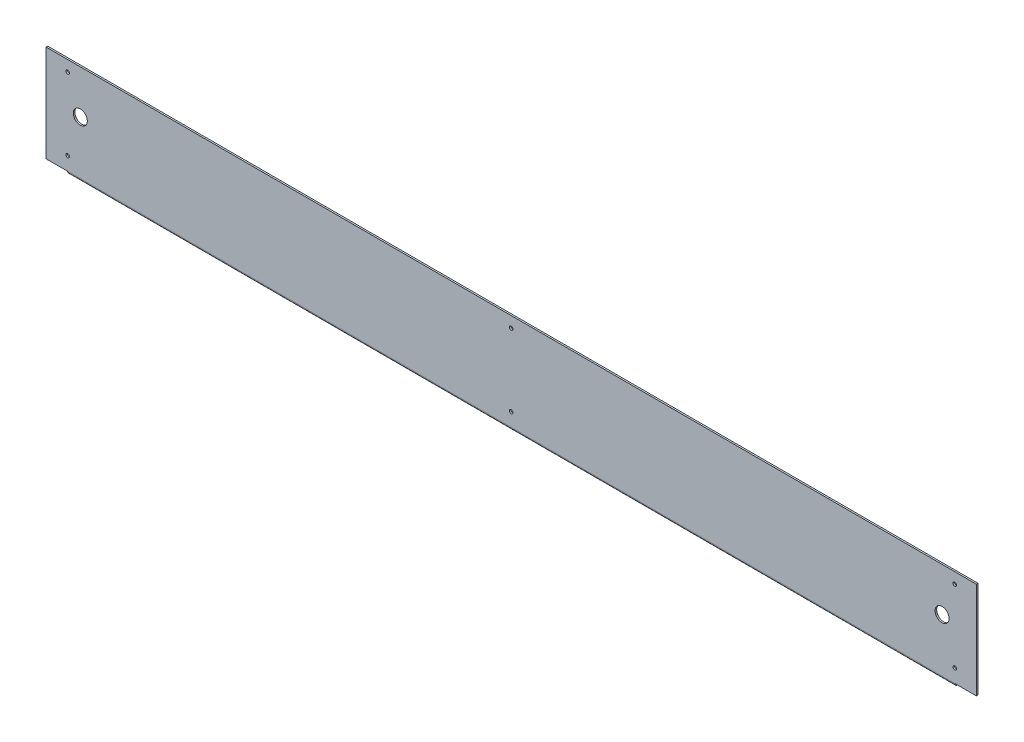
ISO-10303-21;
HEADER;
FILE_DESCRIPTION(('STEP AP214'),'2;1');
FILE_NAME('part.step','',(''),(''),'','','');
FILE_SCHEMA(('AUTOMOTIVE_DESIGN { 1 0 10303 214 1 1 1 1 }'));
ENDSEC;
DATA;
#1=APPLICATION_CONTEXT('core data for automotive mechanical design processes');
#2=APPLICATION_PROTOCOL_DEFINITION('international standard','automotive_design',2000,#1);
#3=PRODUCT_CONTEXT('',#1,'mechanical');
#4=PRODUCT('Part','Part','',(#3));
#5=PRODUCT_RELATED_PRODUCT_CATEGORY('part','',(#4));
#6=PRODUCT_DEFINITION_FORMATION('','',#4);
#7=PRODUCT_DEFINITION_CONTEXT('part definition',#1,'design');
#8=PRODUCT_DEFINITION('design','',#6,#7);
#9=PRODUCT_DEFINITION_SHAPE('','',#8);
#10=(LENGTH_UNIT() NAMED_UNIT(*) SI_UNIT(.MILLI.,.METRE.));
#11=(NAMED_UNIT(*) PLANE_ANGLE_UNIT() SI_UNIT($,.RADIAN.));
#12=(NAMED_UNIT(*) SI_UNIT($,.STERADIAN.) SOLID_ANGLE_UNIT());
#13=UNCERTAINTY_MEASURE_WITH_UNIT(LENGTH_MEASURE(1.E-05),#10,'distance_accuracy_value','');
#14=(GEOMETRIC_REPRESENTATION_CONTEXT(3) GLOBAL_UNCERTAINTY_ASSIGNED_CONTEXT((#13)) GLOBAL_UNIT_ASSIGNED_CONTEXT((#10,
#11,#12)) REPRESENTATION_CONTEXT('',''));
#15=CARTESIAN_POINT('',(0.,0.,0.));
#16=DIRECTION('',(0.,0.,1.));
#17=DIRECTION('',(1.,0.,0.));
#18=AXIS2_PLACEMENT_3D('',#15,#16,#17);
#19=CARTESIAN_POINT('',(-430.1,-100.999999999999,1.5));
#20=DIRECTION('',(0.,1.,0.));
#21=DIRECTION('',(-1.,0.,0.));
#22=AXIS2_PLACEMENT_3D('',#19,#20,#21);
#23=PLANE('',#22);
#24=DIRECTION('',(0.,-1.9428902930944E-13,1.));
#25=VECTOR('',#24,1.);
#26=CARTESIAN_POINT('',(410.1,-100.999999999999,-1.72171304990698E-13));
#27=LINE('',#26,#25);
#28=CARTESIAN_POINT('',(410.1,-100.999999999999,-1.72171304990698E-13));
#29=VERTEX_POINT('',#28);
#30=CARTESIAN_POINT('',(410.1,-101.,1.49999999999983));
#31=VERTEX_POINT('',#30);
#32=EDGE_CURVE('E205',#29,#31,#27,.T.);
#33=ORIENTED_EDGE('',*,*,#32,.F.);
#34=DIRECTION('',(1.,0.,0.));
#35=VECTOR('',#34,1.);
#36=CARTESIAN_POINT('',(-430.1,-100.999999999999,0.));
#37=LINE('',#36,#35);
#38=CARTESIAN_POINT('',(430.1,-100.999999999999,0.));
#39=VERTEX_POINT('',#38);
#40=EDGE_CURVE('E219',#29,#39,#37,.T.);
#41=ORIENTED_EDGE('',*,*,#40,.T.);
#42=DIRECTION('',(0.,0.,-1.));
#43=VECTOR('',#42,1.);
#44=CARTESIAN_POINT('',(430.1,-100.999999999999,1.5));
#45=LINE('',#44,#43);
#46=CARTESIAN_POINT('',(430.1,-100.999999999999,1.5));
#47=VERTEX_POINT('',#46);
#48=EDGE_CURVE('E66',#47,#39,#45,.T.);
#49=ORIENTED_EDGE('',*,*,#48,.F.);
#50=DIRECTION('',(1.,0.,0.));
#51=VECTOR('',#50,1.);
#52=CARTESIAN_POINT('',(-430.1,-100.999999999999,1.5));
#53=LINE('',#52,#51);
#54=EDGE_CURVE('E211',#31,#47,#53,.T.);
#55=ORIENTED_EDGE('',*,*,#54,.F.);
#56=EDGE_LOOP('',(#33,#41,#49,#55));
#57=FACE_BOUND('',#56,.T.);
#58=ADVANCED_FACE('F58',(#57),#23,.F.);
#59=CARTESIAN_POINT('',(-430.1,-11.4999999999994,1.5));
#60=DIRECTION('',(1.,0.,0.));
#61=DIRECTION('',(0.,0.,-1.));
#62=AXIS2_PLACEMENT_3D('',#59,#60,#61);
#63=PLANE('',#62);
#64=DIRECTION('',(0.,-1.,0.));
#65=VECTOR('',#64,1.);
#66=CARTESIAN_POINT('',(-430.1,-11.4999999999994,0.));
#67=LINE('',#66,#65);
#68=CARTESIAN_POINT('',(-430.1,-11.4999999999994,0.));
#69=VERTEX_POINT('',#68);
#70=CARTESIAN_POINT('',(-430.1,-100.999999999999,0.));
#71=VERTEX_POINT('',#70);
#72=EDGE_CURVE('E207',#69,#71,#67,.T.);
#73=ORIENTED_EDGE('',*,*,#72,.T.);
#74=DIRECTION('',(0.,0.,-1.));
#75=VECTOR('',#74,1.);
#76=CARTESIAN_POINT('',(-430.1,-100.999999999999,1.5));
#77=LINE('',#76,#75);
#78=CARTESIAN_POINT('',(-430.1,-100.999999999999,1.5));
#79=VERTEX_POINT('',#78);
#80=EDGE_CURVE('E13',#79,#71,#77,.T.);
#81=ORIENTED_EDGE('',*,*,#80,.F.);
#82=DIRECTION('',(0.,-1.,0.));
#83=VECTOR('',#82,1.);
#84=CARTESIAN_POINT('',(-430.1,-11.4999999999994,1.5));
#85=LINE('',#84,#83);
#86=CARTESIAN_POINT('',(-430.1,-11.4999999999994,1.5));
#87=VERTEX_POINT('',#86);
#88=EDGE_CURVE('E209',#87,#79,#85,.T.);
#89=ORIENTED_EDGE('',*,*,#88,.F.);
#90=DIRECTION('',(0.,0.,-1.));
#91=VECTOR('',#90,1.);
#92=CARTESIAN_POINT('',(-430.1,-11.4999999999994,1.5));
#93=LINE('',#92,#91);
#94=EDGE_CURVE('E216',#87,#69,#93,.T.);
#95=ORIENTED_EDGE('',*,*,#94,.T.);
#96=EDGE_LOOP('',(#73,#81,#89,#95));
#97=FACE_BOUND('',#96,.T.);
#98=ADVANCED_FACE('F60',(#97),#63,.F.);
#99=CARTESIAN_POINT('',(-410.1,-100.999999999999,0.));
#100=VERTEX_POINT('',#99);
#101=EDGE_CURVE('E220',#71,#100,#37,.T.);
#102=ORIENTED_EDGE('',*,*,#101,.T.);
#103=DIRECTION('',(0.,-1.9428902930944E-13,1.));
#104=VECTOR('',#103,1.);
#105=CARTESIAN_POINT('',(-410.1,-100.999999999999,0.));
#106=LINE('',#105,#104);
#107=CARTESIAN_POINT('',(-410.1,-100.999999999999,1.5));
#108=VERTEX_POINT('',#107);
#109=EDGE_CURVE('E198',#100,#108,#106,.T.);
#110=ORIENTED_EDGE('',*,*,#109,.T.);
#111=EDGE_CURVE('E110',#79,#108,#53,.T.);
#112=ORIENTED_EDGE('',*,*,#111,.F.);
#113=ORIENTED_EDGE('',*,*,#80,.T.);
#114=EDGE_LOOP('',(#102,#110,#112,#113));
#115=FACE_BOUND('',#114,.T.);
#116=ADVANCED_FACE('F255',(#115),#23,.F.);
#117=CARTESIAN_POINT('',(430.1,-11.499999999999,1.5));
#118=DIRECTION('',(-1.,0.,0.));
#119=DIRECTION('',(0.,0.,1.));
#120=AXIS2_PLACEMENT_3D('',#117,#118,#119);
#121=PLANE('',#120);
#122=DIRECTION('',(0.,1.,0.));
#123=VECTOR('',#122,1.);
#124=CARTESIAN_POINT('',(430.1,-11.499999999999,0.));
#125=LINE('',#124,#123);
#126=CARTESIAN_POINT('',(430.1,-11.499999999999,0.));
#127=VERTEX_POINT('',#126);
#128=EDGE_CURVE('E223',#39,#127,#125,.T.);
#129=ORIENTED_EDGE('',*,*,#128,.T.);
#130=DIRECTION('',(0.,0.,-1.));
#131=VECTOR('',#130,1.);
#132=CARTESIAN_POINT('',(430.1,-11.499999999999,1.5));
#133=LINE('',#132,#131);
#134=CARTESIAN_POINT('',(430.1,-11.499999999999,1.5));
#135=VERTEX_POINT('',#134);
#136=EDGE_CURVE('E227',#135,#127,#133,.T.);
#137=ORIENTED_EDGE('',*,*,#136,.F.);
#138=DIRECTION('',(0.,1.,0.));
#139=VECTOR('',#138,1.);
#140=CARTESIAN_POINT('',(430.1,-11.499999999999,1.5));
#141=LINE('',#140,#139);
#142=EDGE_CURVE('E213',#47,#135,#141,.T.);
#143=ORIENTED_EDGE('',*,*,#142,.F.);
#144=ORIENTED_EDGE('',*,*,#48,.T.);
#145=EDGE_LOOP('',(#129,#137,#143,#144));
#146=FACE_BOUND('',#145,.T.);
#147=ADVANCED_FACE('F233',(#146),#121,.F.);
#148=CARTESIAN_POINT('',(-430.1,-11.4999999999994,1.5));
#149=DIRECTION('',(0.,-1.,0.));
#150=DIRECTION('',(1.,0.,0.));
#151=AXIS2_PLACEMENT_3D('',#148,#149,#150);
#152=PLANE('',#151);
#153=DIRECTION('',(-1.,0.,0.));
#154=VECTOR('',#153,1.);
#155=CARTESIAN_POINT('',(-430.1,-11.4999999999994,0.));
#156=LINE('',#155,#154);
#157=EDGE_CURVE('E103',#127,#69,#156,.T.);
#158=ORIENTED_EDGE('',*,*,#157,.T.);
#159=ORIENTED_EDGE('',*,*,#94,.F.);
#160=DIRECTION('',(-1.,0.,0.));
#161=VECTOR('',#160,1.);
#162=CARTESIAN_POINT('',(-430.1,-11.4999999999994,1.5));
#163=LINE('',#162,#161);
#164=EDGE_CURVE('E82',#135,#87,#163,.T.);
#165=ORIENTED_EDGE('',*,*,#164,.F.);
#166=ORIENTED_EDGE('',*,*,#136,.T.);
#167=EDGE_LOOP('',(#158,#159,#165,#166));
#168=FACE_BOUND('',#167,.T.);
#169=ADVANCED_FACE('F245',(#168),#152,.F.);
#170=CARTESIAN_POINT('',(0.,0.,1.5));
#171=DIRECTION('',(0.,0.,1.));
#172=DIRECTION('',(1.,0.,0.));
#173=AXIS2_PLACEMENT_3D('',#170,#171,#172);
#174=PLANE('',#173);
#175=CARTESIAN_POINT('',(398.399999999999,-51.7500000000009,1.5));
#176=DIRECTION('',(0.,0.,1.));
#177=DIRECTION('',(1.,0.,0.));
#178=AXIS2_PLACEMENT_3D('',#175,#176,#177);
#179=CIRCLE('',#178,6.50000000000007);
#180=CARTESIAN_POINT('',(404.899999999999,-51.7500000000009,1.5));
#181=VERTEX_POINT('',#180);
#182=EDGE_CURVE('E324',#181,#181,#179,.T.);
#183=ORIENTED_EDGE('',*,*,#182,.F.);
#184=EDGE_LOOP('',(#183));
#185=FACE_BOUND('',#184,.T.);
#186=CARTESIAN_POINT('',(-398.4,-51.7500000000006,1.5));
#187=DIRECTION('',(0.,0.,1.));
#188=DIRECTION('',(1.,0.,0.));
#189=AXIS2_PLACEMENT_3D('',#186,#187,#188);
#190=CIRCLE('',#189,6.50000000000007);
#191=CARTESIAN_POINT('',(-391.9,-51.7500000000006,1.5));
#192=VERTEX_POINT('',#191);
#193=EDGE_CURVE('E318',#192,#192,#190,.T.);
#194=ORIENTED_EDGE('',*,*,#193,.F.);
#195=EDGE_LOOP('',(#194));
#196=FACE_BOUND('',#195,.T.);
#197=CARTESIAN_POINT('',(410.1,-21.4999999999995,1.5));
#198=DIRECTION('',(0.,0.,1.));
#199=DIRECTION('',(1.,0.,0.));
#200=AXIS2_PLACEMENT_3D('',#197,#198,#199);
#201=CIRCLE('',#200,1.65000000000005);
#202=CARTESIAN_POINT('',(411.75,-21.4999999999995,1.5));
#203=VERTEX_POINT('',#202);
#204=EDGE_CURVE('E300',#203,#203,#201,.T.);
#205=ORIENTED_EDGE('',*,*,#204,.F.);
#206=EDGE_LOOP('',(#205));
#207=FACE_BOUND('',#206,.T.);
#208=CARTESIAN_POINT('',(4.44089209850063E-13,-88.4999999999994,1.5));
#209=DIRECTION('',(0.,0.,1.));
#210=DIRECTION('',(1.,0.,0.));
#211=AXIS2_PLACEMENT_3D('',#208,#209,#210);
#212=CIRCLE('',#211,1.64999999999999);
#213=CARTESIAN_POINT('',(1.65000000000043,-88.4999999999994,1.5));
#214=VERTEX_POINT('',#213);
#215=EDGE_CURVE('E307',#214,#214,#212,.T.);
#216=ORIENTED_EDGE('',*,*,#215,.F.);
#217=EDGE_LOOP('',(#216));
#218=FACE_BOUND('',#217,.T.);
#219=CARTESIAN_POINT('',(-1.66533453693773E-13,-21.4999999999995,1.5));
#220=DIRECTION('',(0.,0.,1.));
#221=DIRECTION('',(1.,0.,0.));
#222=AXIS2_PLACEMENT_3D('',#219,#220,#221);
#223=CIRCLE('',#222,1.64999999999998);
#224=CARTESIAN_POINT('',(1.64999999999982,-21.4999999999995,1.5));
#225=VERTEX_POINT('',#224);
#226=EDGE_CURVE('E288',#225,#225,#223,.T.);
#227=ORIENTED_EDGE('',*,*,#226,.F.);
#228=EDGE_LOOP('',(#227));
#229=FACE_BOUND('',#228,.T.);
#230=CARTESIAN_POINT('',(-410.099999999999,-88.4999999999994,1.5));
#231=DIRECTION('',(0.,0.,1.));
#232=DIRECTION('',(1.,0.,0.));
#233=AXIS2_PLACEMENT_3D('',#230,#231,#232);
#234=CIRCLE('',#233,1.65000000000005);
#235=CARTESIAN_POINT('',(-408.449999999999,-88.4999999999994,1.5));
#236=VERTEX_POINT('',#235);
#237=EDGE_CURVE('E295',#236,#236,#234,.T.);
#238=ORIENTED_EDGE('',*,*,#237,.F.);
#239=EDGE_LOOP('',(#238));
#240=FACE_BOUND('',#239,.T.);
#241=CARTESIAN_POINT('',(410.1,-88.4999999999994,1.5));
#242=DIRECTION('',(0.,0.,1.));
#243=DIRECTION('',(1.,0.,0.));
#244=AXIS2_PLACEMENT_3D('',#241,#242,#243);
#245=CIRCLE('',#244,1.65000000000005);
#246=CARTESIAN_POINT('',(411.75,-88.4999999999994,1.5));
#247=VERTEX_POINT('',#246);
#248=EDGE_CURVE('E312',#247,#247,#245,.T.);
#249=ORIENTED_EDGE('',*,*,#248,.F.);
#250=EDGE_LOOP('',(#249));
#251=FACE_BOUND('',#250,.T.);
#252=CARTESIAN_POINT('',(-410.1,-21.4999999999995,1.5));
#253=DIRECTION('',(0.,0.,1.));
#254=DIRECTION('',(1.,0.,0.));
#255=AXIS2_PLACEMENT_3D('',#252,#253,#254);
#256=CIRCLE('',#255,1.65000000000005);
#257=CARTESIAN_POINT('',(-408.45,-21.4999999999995,1.5));
#258=VERTEX_POINT('',#257);
#259=EDGE_CURVE('E282',#258,#258,#256,.T.);
#260=ORIENTED_EDGE('',*,*,#259,.F.);
#261=EDGE_LOOP('',(#260));
#262=FACE_BOUND('',#261,.T.);
#263=ORIENTED_EDGE('',*,*,#88,.T.);
#264=ORIENTED_EDGE('',*,*,#111,.T.);
#265=DIRECTION('',(-1.,0.,0.));
#266=VECTOR('',#265,1.);
#267=CARTESIAN_POINT('',(-410.1,-101.,1.49999999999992));
#268=LINE('',#267,#266);
#269=EDGE_CURVE('E149',#108,#31,#268,.F.);
#270=ORIENTED_EDGE('',*,*,#269,.T.);
#271=ORIENTED_EDGE('',*,*,#54,.T.);
#272=ORIENTED_EDGE('',*,*,#142,.T.);
#273=ORIENTED_EDGE('',*,*,#164,.T.);
#274=EDGE_LOOP('',(#263,#264,#270,#271,#272,#273));
#275=FACE_BOUND('',#274,.T.);
#276=ADVANCED_FACE('F247',(#185,#196,#207,#218,#229,#240,#251,#262,#275),#174,.T.);
#277=CARTESIAN_POINT('',(0.,0.,0.));
#278=DIRECTION('',(0.,0.,1.));
#279=DIRECTION('',(1.,0.,0.));
#280=AXIS2_PLACEMENT_3D('',#277,#278,#279);
#281=PLANE('',#280);
#282=CARTESIAN_POINT('',(398.399999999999,-51.7500000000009,0.));
#283=DIRECTION('',(0.,0.,1.));
#284=DIRECTION('',(1.,0.,0.));
#285=AXIS2_PLACEMENT_3D('',#282,#283,#284);
#286=CIRCLE('',#285,6.50000000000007);
#287=CARTESIAN_POINT('',(404.899999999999,-51.7500000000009,0.));
#288=VERTEX_POINT('',#287);
#289=EDGE_CURVE('E315',#288,#288,#286,.T.);
#290=ORIENTED_EDGE('',*,*,#289,.T.);
#291=EDGE_LOOP('',(#290));
#292=FACE_BOUND('',#291,.T.);
#293=CARTESIAN_POINT('',(-398.4,-51.7500000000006,0.));
#294=DIRECTION('',(0.,0.,1.));
#295=DIRECTION('',(1.,0.,0.));
#296=AXIS2_PLACEMENT_3D('',#293,#294,#295);
#297=CIRCLE('',#296,6.50000000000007);
#298=CARTESIAN_POINT('',(-391.9,-51.7500000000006,0.));
#299=VERTEX_POINT('',#298);
#300=EDGE_CURVE('E321',#299,#299,#297,.T.);
#301=ORIENTED_EDGE('',*,*,#300,.T.);
#302=EDGE_LOOP('',(#301));
#303=FACE_BOUND('',#302,.T.);
#304=CARTESIAN_POINT('',(410.1,-21.4999999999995,0.));
#305=DIRECTION('',(0.,0.,1.));
#306=DIRECTION('',(1.,0.,0.));
#307=AXIS2_PLACEMENT_3D('',#304,#305,#306);
#308=CIRCLE('',#307,1.65000000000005);
#309=CARTESIAN_POINT('',(411.75,-21.4999999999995,0.));
#310=VERTEX_POINT('',#309);
#311=EDGE_CURVE('E303',#310,#310,#308,.T.);
#312=ORIENTED_EDGE('',*,*,#311,.T.);
#313=EDGE_LOOP('',(#312));
#314=FACE_BOUND('',#313,.T.);
#315=CARTESIAN_POINT('',(4.44089209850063E-13,-88.4999999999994,0.));
#316=DIRECTION('',(0.,0.,1.));
#317=DIRECTION('',(1.,0.,0.));
#318=AXIS2_PLACEMENT_3D('',#315,#316,#317);
#319=CIRCLE('',#318,1.64999999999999);
#320=CARTESIAN_POINT('',(1.65000000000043,-88.4999999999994,0.));
#321=VERTEX_POINT('',#320);
#322=EDGE_CURVE('E292',#321,#321,#319,.T.);
#323=ORIENTED_EDGE('',*,*,#322,.T.);
#324=EDGE_LOOP('',(#323));
#325=FACE_BOUND('',#324,.T.);
#326=CARTESIAN_POINT('',(-1.66533453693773E-13,-21.4999999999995,0.));
#327=DIRECTION('',(0.,0.,1.));
#328=DIRECTION('',(1.,0.,0.));
#329=AXIS2_PLACEMENT_3D('',#326,#327,#328);
#330=CIRCLE('',#329,1.64999999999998);
#331=CARTESIAN_POINT('',(1.64999999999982,-21.4999999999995,0.));
#332=VERTEX_POINT('',#331);
#333=EDGE_CURVE('E291',#332,#332,#330,.T.);
#334=ORIENTED_EDGE('',*,*,#333,.T.);
#335=EDGE_LOOP('',(#334));
#336=FACE_BOUND('',#335,.T.);
#337=CARTESIAN_POINT('',(-410.099999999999,-88.4999999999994,0.));
#338=DIRECTION('',(0.,0.,1.));
#339=DIRECTION('',(1.,0.,0.));
#340=AXIS2_PLACEMENT_3D('',#337,#338,#339);
#341=CIRCLE('',#340,1.65000000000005);
#342=CARTESIAN_POINT('',(-408.449999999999,-88.4999999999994,0.));
#343=VERTEX_POINT('',#342);
#344=EDGE_CURVE('E285',#343,#343,#341,.T.);
#345=ORIENTED_EDGE('',*,*,#344,.T.);
#346=EDGE_LOOP('',(#345));
#347=FACE_BOUND('',#346,.T.);
#348=CARTESIAN_POINT('',(410.1,-88.4999999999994,0.));
#349=DIRECTION('',(0.,0.,1.));
#350=DIRECTION('',(1.,0.,0.));
#351=AXIS2_PLACEMENT_3D('',#348,#349,#350);
#352=CIRCLE('',#351,1.65000000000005);
#353=CARTESIAN_POINT('',(411.75,-88.4999999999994,0.));
#354=VERTEX_POINT('',#353);
#355=EDGE_CURVE('E304',#354,#354,#352,.T.);
#356=ORIENTED_EDGE('',*,*,#355,.T.);
#357=EDGE_LOOP('',(#356));
#358=FACE_BOUND('',#357,.T.);
#359=CARTESIAN_POINT('',(-410.1,-21.4999999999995,0.));
#360=DIRECTION('',(0.,0.,1.));
#361=DIRECTION('',(1.,0.,0.));
#362=AXIS2_PLACEMENT_3D('',#359,#360,#361);
#363=CIRCLE('',#362,1.65000000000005);
#364=CARTESIAN_POINT('',(-408.45,-21.4999999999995,0.));
#365=VERTEX_POINT('',#364);
#366=EDGE_CURVE('E195',#365,#365,#363,.T.);
#367=ORIENTED_EDGE('',*,*,#366,.T.);
#368=EDGE_LOOP('',(#367));
#369=FACE_BOUND('',#368,.T.);
#370=ORIENTED_EDGE('',*,*,#72,.F.);
#371=ORIENTED_EDGE('',*,*,#157,.F.);
#372=ORIENTED_EDGE('',*,*,#128,.F.);
#373=ORIENTED_EDGE('',*,*,#40,.F.);
#374=DIRECTION('',(-1.,0.,0.));
#375=VECTOR('',#374,1.);
#376=CARTESIAN_POINT('',(-410.1,-100.999999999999,0.));
#377=LINE('',#376,#375);
#378=EDGE_CURVE('E202',#100,#29,#377,.F.);
#379=ORIENTED_EDGE('',*,*,#378,.F.);
#380=ORIENTED_EDGE('',*,*,#101,.F.);
#381=EDGE_LOOP('',(#370,#371,#372,#373,#379,#380));
#382=FACE_BOUND('',#381,.T.);
#383=ADVANCED_FACE('F240',(#292,#303,#314,#325,#336,#347,#358,#369,#382),#281,.F.);
#384=CARTESIAN_POINT('',(410.1,-100.999999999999,-0.999999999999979));
#385=DIRECTION('',(1.,0.,0.));
#386=DIRECTION('',(0.,0.,-1.));
#387=AXIS2_PLACEMENT_3D('',#384,#385,#386);
#388=PLANE('',#387);
#389=DIRECTION('',(0.,-1.,0.));
#390=VECTOR('',#389,1.);
#391=CARTESIAN_POINT('',(410.1,-103.499999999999,-0.999999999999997));
#392=LINE('',#391,#390);
#393=CARTESIAN_POINT('',(410.1,-101.999999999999,-0.999999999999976));
#394=VERTEX_POINT('',#393);
#395=CARTESIAN_POINT('',(410.1,-103.499999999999,-0.999999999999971));
#396=VERTEX_POINT('',#395);
#397=EDGE_CURVE('E192',#394,#396,#392,.T.);
#398=ORIENTED_EDGE('',*,*,#397,.F.);
#399=CARTESIAN_POINT('',(410.1,-100.999999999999,-0.999999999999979));
#400=DIRECTION('',(-1.,0.,0.));
#401=DIRECTION('',(0.,0.,1.));
#402=AXIS2_PLACEMENT_3D('',#399,#400,#401);
#403=CIRCLE('',#402,0.999999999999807);
#404=EDGE_CURVE('E150',#29,#394,#403,.F.);
#405=ORIENTED_EDGE('',*,*,#404,.F.);
#406=ORIENTED_EDGE('',*,*,#32,.T.);
#407=CARTESIAN_POINT('',(410.1,-100.999999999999,-0.999999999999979));
#408=DIRECTION('',(-1.,0.,0.));
#409=DIRECTION('',(0.,0.,1.));
#410=AXIS2_PLACEMENT_3D('',#407,#408,#409);
#411=CIRCLE('',#410,2.49999999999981);
#412=EDGE_CURVE('E197',#31,#396,#411,.F.);
#413=ORIENTED_EDGE('',*,*,#412,.T.);
#414=EDGE_LOOP('',(#398,#405,#406,#413));
#415=FACE_BOUND('',#414,.T.);
#416=ADVANCED_FACE('F268',(#415),#388,.T.);
#417=CARTESIAN_POINT('',(-410.1,-100.999999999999,-0.99999999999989));
#418=DIRECTION('',(1.,0.,0.));
#419=DIRECTION('',(0.,0.,-1.));
#420=AXIS2_PLACEMENT_3D('',#417,#418,#419);
#421=PLANE('',#420);
#422=CARTESIAN_POINT('',(-410.1,-100.999999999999,-0.99999999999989));
#423=DIRECTION('',(-1.,0.,0.));
#424=DIRECTION('',(0.,0.,1.));
#425=AXIS2_PLACEMENT_3D('',#422,#423,#424);
#426=CIRCLE('',#425,0.999999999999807);
#427=CARTESIAN_POINT('',(-410.1,-101.999999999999,-0.999999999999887));
#428=VERTEX_POINT('',#427);
#429=EDGE_CURVE('E157',#428,#100,#426,.T.);
#430=ORIENTED_EDGE('',*,*,#429,.F.);
#431=DIRECTION('',(0.,-1.,0.));
#432=VECTOR('',#431,1.);
#433=CARTESIAN_POINT('',(-410.1,-101.999999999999,-0.999999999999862));
#434=LINE('',#433,#432);
#435=CARTESIAN_POINT('',(-410.1,-103.499999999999,-0.999999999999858));
#436=VERTEX_POINT('',#435);
#437=EDGE_CURVE('E154',#428,#436,#434,.T.);
#438=ORIENTED_EDGE('',*,*,#437,.T.);
#439=CARTESIAN_POINT('',(-410.1,-100.999999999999,-0.99999999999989));
#440=DIRECTION('',(-1.,0.,0.));
#441=DIRECTION('',(0.,0.,1.));
#442=AXIS2_PLACEMENT_3D('',#439,#440,#441);
#443=CIRCLE('',#442,2.49999999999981);
#444=EDGE_CURVE('E73',#436,#108,#443,.T.);
#445=ORIENTED_EDGE('',*,*,#444,.T.);
#446=ORIENTED_EDGE('',*,*,#109,.F.);
#447=EDGE_LOOP('',(#430,#438,#445,#446));
#448=FACE_BOUND('',#447,.T.);
#449=ADVANCED_FACE('F155',(#448),#421,.F.);
#450=CARTESIAN_POINT('',(-410.1,-100.999999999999,-0.99999999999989));
#451=DIRECTION('',(-1.,0.,0.));
#452=DIRECTION('',(0.,-1.,0.));
#453=AXIS2_PLACEMENT_3D('',#450,#451,#452);
#454=CYLINDRICAL_SURFACE('',#453,2.49999999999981);
#455=ORIENTED_EDGE('',*,*,#269,.F.);
#456=ORIENTED_EDGE('',*,*,#444,.F.);
#457=DIRECTION('',(-1.,0.,0.));
#458=VECTOR('',#457,1.);
#459=CARTESIAN_POINT('',(0.,-103.499999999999,-0.999999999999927));
#460=LINE('',#459,#458);
#461=EDGE_CURVE('E146',#396,#436,#460,.T.);
#462=ORIENTED_EDGE('',*,*,#461,.F.);
#463=ORIENTED_EDGE('',*,*,#412,.F.);
#464=EDGE_LOOP('',(#455,#456,#462,#463));
#465=FACE_BOUND('',#464,.T.);
#466=ADVANCED_FACE('F143',(#465),#454,.T.);
#467=CARTESIAN_POINT('',(-410.1,-100.999999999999,-0.99999999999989));
#468=DIRECTION('',(-1.,0.,0.));
#469=DIRECTION('',(0.,-1.,0.));
#470=AXIS2_PLACEMENT_3D('',#467,#468,#469);
#471=CYLINDRICAL_SURFACE('',#470,0.999999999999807);
#472=ORIENTED_EDGE('',*,*,#378,.T.);
#473=ORIENTED_EDGE('',*,*,#404,.T.);
#474=DIRECTION('',(1.,0.,0.));
#475=VECTOR('',#474,1.);
#476=CARTESIAN_POINT('',(410.1,-101.999999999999,-1.));
#477=LINE('',#476,#475);
#478=EDGE_CURVE('E162',#394,#428,#477,.F.);
#479=ORIENTED_EDGE('',*,*,#478,.T.);
#480=ORIENTED_EDGE('',*,*,#429,.T.);
#481=EDGE_LOOP('',(#472,#473,#479,#480));
#482=FACE_BOUND('',#481,.T.);
#483=ADVANCED_FACE('F271',(#482),#471,.F.);
#484=CARTESIAN_POINT('',(-410.1,-103.499999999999,1.62886004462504E-13));
#485=DIRECTION('',(-1.,0.,0.));
#486=DIRECTION('',(0.,0.,1.));
#487=AXIS2_PLACEMENT_3D('',#484,#485,#486);
#488=PLANE('',#487);
#489=DIRECTION('',(0.,0.,1.));
#490=VECTOR('',#489,1.);
#491=CARTESIAN_POINT('',(-410.1,-103.499999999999,1.62886004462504E-13));
#492=LINE('',#491,#490);
#493=CARTESIAN_POINT('',(-410.1,-103.499999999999,-18.5));
#494=VERTEX_POINT('',#493);
#495=EDGE_CURVE('E169',#494,#436,#492,.T.);
#496=ORIENTED_EDGE('',*,*,#495,.T.);
#497=ORIENTED_EDGE('',*,*,#437,.F.);
#498=DIRECTION('',(0.,0.,-1.));
#499=VECTOR('',#498,1.);
#500=CARTESIAN_POINT('',(-410.1,-101.999999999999,-9.27486315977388E-13));
#501=LINE('',#500,#499);
#502=CARTESIAN_POINT('',(-410.1,-101.999999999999,-18.5));
#503=VERTEX_POINT('',#502);
#504=EDGE_CURVE('E185',#503,#428,#501,.F.);
#505=ORIENTED_EDGE('',*,*,#504,.F.);
#506=DIRECTION('',(0.,1.,0.));
#507=VECTOR('',#506,1.);
#508=CARTESIAN_POINT('',(-410.1,-103.499999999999,-18.5));
#509=LINE('',#508,#507);
#510=EDGE_CURVE('E174',#494,#503,#509,.T.);
#511=ORIENTED_EDGE('',*,*,#510,.F.);
#512=EDGE_LOOP('',(#496,#497,#505,#511));
#513=FACE_BOUND('',#512,.T.);
#514=ADVANCED_FACE('F173',(#513),#488,.T.);
#515=CARTESIAN_POINT('',(410.1,-103.499999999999,-18.5));
#516=DIRECTION('',(1.,0.,0.));
#517=DIRECTION('',(0.,1.,0.));
#518=AXIS2_PLACEMENT_3D('',#515,#516,#517);
#519=PLANE('',#518);
#520=DIRECTION('',(0.,0.,1.));
#521=VECTOR('',#520,1.);
#522=CARTESIAN_POINT('',(410.1,-101.999999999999,3.0306087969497E-13));
#523=LINE('',#522,#521);
#524=CARTESIAN_POINT('',(410.1,-101.999999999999,-18.5));
#525=VERTEX_POINT('',#524);
#526=EDGE_CURVE('E171',#394,#525,#523,.F.);
#527=ORIENTED_EDGE('',*,*,#526,.F.);
#528=ORIENTED_EDGE('',*,*,#397,.T.);
#529=DIRECTION('',(0.,0.,-1.));
#530=VECTOR('',#529,1.);
#531=CARTESIAN_POINT('',(410.1,-103.499999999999,-18.5));
#532=LINE('',#531,#530);
#533=CARTESIAN_POINT('',(410.1,-103.499999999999,-18.5));
#534=VERTEX_POINT('',#533);
#535=EDGE_CURVE('E170',#396,#534,#532,.T.);
#536=ORIENTED_EDGE('',*,*,#535,.T.);
#537=DIRECTION('',(0.,1.,0.));
#538=VECTOR('',#537,1.);
#539=CARTESIAN_POINT('',(410.1,-103.499999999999,-18.5));
#540=LINE('',#539,#538);
#541=EDGE_CURVE('E176',#534,#525,#540,.T.);
#542=ORIENTED_EDGE('',*,*,#541,.T.);
#543=EDGE_LOOP('',(#527,#528,#536,#542));
#544=FACE_BOUND('',#543,.T.);
#545=ADVANCED_FACE('F276',(#544),#519,.T.);
#546=CARTESIAN_POINT('',(0.,-103.499999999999,3.08298101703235E-13));
#547=DIRECTION('',(0.,-1.,0.));
#548=DIRECTION('',(0.,0.,-1.));
#549=AXIS2_PLACEMENT_3D('',#546,#547,#548);
#550=PLANE('',#549);
#551=ORIENTED_EDGE('',*,*,#535,.F.);
#552=ORIENTED_EDGE('',*,*,#461,.T.);
#553=ORIENTED_EDGE('',*,*,#495,.F.);
#554=DIRECTION('',(-1.,0.,0.));
#555=VECTOR('',#554,1.);
#556=CARTESIAN_POINT('',(-410.1,-103.499999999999,-18.5));
#557=LINE('',#556,#555);
#558=EDGE_CURVE('E177',#534,#494,#557,.T.);
#559=ORIENTED_EDGE('',*,*,#558,.F.);
#560=EDGE_LOOP('',(#551,#552,#553,#559));
#561=FACE_BOUND('',#560,.T.);
#562=ADVANCED_FACE('F167',(#561),#550,.T.);
#563=CARTESIAN_POINT('',(0.,-101.999999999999,3.0306087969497E-13));
#564=DIRECTION('',(0.,-1.,0.));
#565=DIRECTION('',(0.,0.,-1.));
#566=AXIS2_PLACEMENT_3D('',#563,#564,#565);
#567=PLANE('',#566);
#568=ORIENTED_EDGE('',*,*,#478,.F.);
#569=ORIENTED_EDGE('',*,*,#526,.T.);
#570=DIRECTION('',(1.,0.,0.));
#571=VECTOR('',#570,1.);
#572=CARTESIAN_POINT('',(0.,-101.999999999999,-18.5));
#573=LINE('',#572,#571);
#574=EDGE_CURVE('E187',#525,#503,#573,.F.);
#575=ORIENTED_EDGE('',*,*,#574,.T.);
#576=ORIENTED_EDGE('',*,*,#504,.T.);
#577=EDGE_LOOP('',(#568,#569,#575,#576));
#578=FACE_BOUND('',#577,.T.);
#579=ADVANCED_FACE('F274',(#578),#567,.F.);
#580=CARTESIAN_POINT('',(-410.1,-103.499999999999,-18.5));
#581=DIRECTION('',(0.,0.,-1.));
#582=DIRECTION('',(0.,1.,0.));
#583=AXIS2_PLACEMENT_3D('',#580,#581,#582);
#584=PLANE('',#583);
#585=ORIENTED_EDGE('',*,*,#574,.F.);
#586=ORIENTED_EDGE('',*,*,#541,.F.);
#587=ORIENTED_EDGE('',*,*,#558,.T.);
#588=ORIENTED_EDGE('',*,*,#510,.T.);
#589=EDGE_LOOP('',(#585,#586,#587,#588));
#590=FACE_BOUND('',#589,.T.);
#591=ADVANCED_FACE('F280',(#590),#584,.T.);
#592=CARTESIAN_POINT('',(-410.1,-21.4999999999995,0.));
#593=DIRECTION('',(0.,0.,1.));
#594=DIRECTION('',(1.,0.,0.));
#595=AXIS2_PLACEMENT_3D('',#592,#593,#594);
#596=CYLINDRICAL_SURFACE('',#595,1.65000000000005);
#597=ORIENTED_EDGE('',*,*,#366,.F.);
#598=EDGE_LOOP('',(#597));
#599=FACE_BOUND('',#598,.T.);
#600=ORIENTED_EDGE('',*,*,#259,.T.);
#601=EDGE_LOOP('',(#600));
#602=FACE_BOUND('',#601,.T.);
#603=ADVANCED_FACE('F353',(#599,#602),#596,.F.);
#604=CARTESIAN_POINT('',(410.1,-88.4999999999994,0.));
#605=DIRECTION('',(0.,0.,1.));
#606=DIRECTION('',(1.,0.,0.));
#607=AXIS2_PLACEMENT_3D('',#604,#605,#606);
#608=CYLINDRICAL_SURFACE('',#607,1.65000000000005);
#609=ORIENTED_EDGE('',*,*,#355,.F.);
#610=EDGE_LOOP('',(#609));
#611=FACE_BOUND('',#610,.T.);
#612=ORIENTED_EDGE('',*,*,#248,.T.);
#613=EDGE_LOOP('',(#612));
#614=FACE_BOUND('',#613,.T.);
#615=ADVANCED_FACE('F355',(#611,#614),#608,.F.);
#616=CARTESIAN_POINT('',(-410.099999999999,-88.4999999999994,0.));
#617=DIRECTION('',(0.,0.,1.));
#618=DIRECTION('',(1.,0.,0.));
#619=AXIS2_PLACEMENT_3D('',#616,#617,#618);
#620=CYLINDRICAL_SURFACE('',#619,1.65000000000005);
#621=ORIENTED_EDGE('',*,*,#344,.F.);
#622=EDGE_LOOP('',(#621));
#623=FACE_BOUND('',#622,.T.);
#624=ORIENTED_EDGE('',*,*,#237,.T.);
#625=EDGE_LOOP('',(#624));
#626=FACE_BOUND('',#625,.T.);
#627=ADVANCED_FACE('F362',(#623,#626),#620,.F.);
#628=CARTESIAN_POINT('',(-1.66533453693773E-13,-21.4999999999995,0.));
#629=DIRECTION('',(0.,0.,1.));
#630=DIRECTION('',(1.,0.,0.));
#631=AXIS2_PLACEMENT_3D('',#628,#629,#630);
#632=CYLINDRICAL_SURFACE('',#631,1.64999999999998);
#633=ORIENTED_EDGE('',*,*,#333,.F.);
#634=EDGE_LOOP('',(#633));
#635=FACE_BOUND('',#634,.T.);
#636=ORIENTED_EDGE('',*,*,#226,.T.);
#637=EDGE_LOOP('',(#636));
#638=FACE_BOUND('',#637,.T.);
#639=ADVANCED_FACE('F369',(#635,#638),#632,.F.);
#640=CARTESIAN_POINT('',(4.44089209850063E-13,-88.4999999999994,0.));
#641=DIRECTION('',(0.,0.,1.));
#642=DIRECTION('',(1.,0.,0.));
#643=AXIS2_PLACEMENT_3D('',#640,#641,#642);
#644=CYLINDRICAL_SURFACE('',#643,1.64999999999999);
#645=ORIENTED_EDGE('',*,*,#322,.F.);
#646=EDGE_LOOP('',(#645));
#647=FACE_BOUND('',#646,.T.);
#648=ORIENTED_EDGE('',*,*,#215,.T.);
#649=EDGE_LOOP('',(#648));
#650=FACE_BOUND('',#649,.T.);
#651=ADVANCED_FACE('F459',(#647,#650),#644,.F.);
#652=CARTESIAN_POINT('',(410.1,-21.4999999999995,0.));
#653=DIRECTION('',(0.,0.,1.));
#654=DIRECTION('',(1.,0.,0.));
#655=AXIS2_PLACEMENT_3D('',#652,#653,#654);
#656=CYLINDRICAL_SURFACE('',#655,1.65000000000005);
#657=ORIENTED_EDGE('',*,*,#311,.F.);
#658=EDGE_LOOP('',(#657));
#659=FACE_BOUND('',#658,.T.);
#660=ORIENTED_EDGE('',*,*,#204,.T.);
#661=EDGE_LOOP('',(#660));
#662=FACE_BOUND('',#661,.T.);
#663=ADVANCED_FACE('F469',(#659,#662),#656,.F.);
#664=CARTESIAN_POINT('',(-398.4,-51.7500000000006,0.));
#665=DIRECTION('',(0.,0.,1.));
#666=DIRECTION('',(1.,0.,0.));
#667=AXIS2_PLACEMENT_3D('',#664,#665,#666);
#668=CYLINDRICAL_SURFACE('',#667,6.50000000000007);
#669=ORIENTED_EDGE('',*,*,#300,.F.);
#670=EDGE_LOOP('',(#669));
#671=FACE_BOUND('',#670,.T.);
#672=ORIENTED_EDGE('',*,*,#193,.T.);
#673=EDGE_LOOP('',(#672));
#674=FACE_BOUND('',#673,.T.);
#675=ADVANCED_FACE('F335',(#671,#674),#668,.F.);
#676=CARTESIAN_POINT('',(398.399999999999,-51.7500000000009,0.));
#677=DIRECTION('',(0.,0.,1.));
#678=DIRECTION('',(1.,0.,0.));
#679=AXIS2_PLACEMENT_3D('',#676,#677,#678);
#680=CYLINDRICAL_SURFACE('',#679,6.50000000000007);
#681=ORIENTED_EDGE('',*,*,#289,.F.);
#682=EDGE_LOOP('',(#681));
#683=FACE_BOUND('',#682,.T.);
#684=ORIENTED_EDGE('',*,*,#182,.T.);
#685=EDGE_LOOP('',(#684));
#686=FACE_BOUND('',#685,.T.);
#687=ADVANCED_FACE('F332',(#683,#686),#680,.F.);
#688=CLOSED_SHELL('',(#58,#98,#116,#147,#169,#276,#383,#416,#449,#466,#483,#514,#545,#562,#579,
#591,#603,#615,#627,#639,#651,#663,#675,#687));
#689=MANIFOLD_SOLID_BREP('B2',#688);
#690=ADVANCED_BREP_SHAPE_REPRESENTATION('',(#18,#689),#14);
#691=SHAPE_DEFINITION_REPRESENTATION(#9,#690);
ENDSEC;
END-ISO-10303-21;
